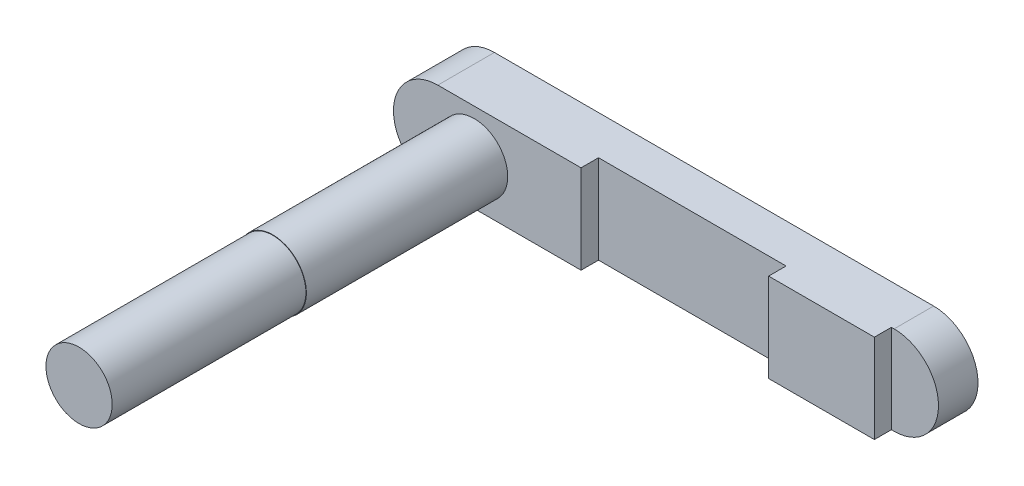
from build123d import *

# Parameters (mm, degrees)
BOSS_EXTRUDE1_DEPTH = 3.96748
SKETCH2_W           = 9.973445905
SKETCH2_H           = 10.38557177
SKETCH2_W_2         = 13.1572
SKETCH2_H_2         = 9.478894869
CUT_EXTRUDE1_DEPTH  = 9.04748
SKETCH3_R           = 2.35585
BOSS_EXTRUDE2_DEPTH = 27.7114
SKETCH4_R           = 4.010294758
SKETCH4_R_2         = 2.3241
CUT_EXTRUDE2_DEPTH  = 13.589


with BuildPart() as part:
    # Sketch1 → Boss-Extrude1 (new body)
    with BuildSketch(Plane.XY):
        with BuildLine():
            Line((3.1115, 6.223), (33.9217, 6.223))
            ThreePointArc((33.9217, 6.223), (37.0332, 3.1115), (33.9217, 0))
            Line((33.9217, 0), (3.1115, 0))
            ThreePointArc((3.1115, 0), (0, 3.1115), (3.1115, 6.223))
        make_face()
    extrude(amount=BOSS_EXTRUDE1_DEPTH)

    # Sketch2 → Cut-Extrude1 (cut)
    with BuildSketch(Plane(origin=(0, 0, 0), x_dir=(1, 0, 0), z_dir=(0, 1, 0))):
        with Locations((38.717922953, -7.964054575)):
            Rectangle(SKETCH2_W, SKETCH2_H)
        with Locations((19.7358, -7.482647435)):
            Rectangle(SKETCH2_W_2, SKETCH2_H_2)
    extrude(amount=CUT_EXTRUDE1_DEPTH, mode=Mode.SUBTRACT)

    # Sketch3 → Boss-Extrude2 (add)
    with BuildSketch(Plane.XY.offset(3.96748)):
        with Locations(Location((5.65785, 3.1115, 0), (0, 0, 180))):
            Circle(SKETCH3_R)
    extrude(amount=BOSS_EXTRUDE2_DEPTH)

    # Sketch4 → Cut-Extrude2 (cut)
    with BuildSketch(Plane.XY.offset(31.67888)):
        with Locations((5.65785, 3.1115)):
            Circle(SKETCH4_R)
        with Locations((5.65785, 3.1115)):
            Circle(SKETCH4_R_2, mode=Mode.SUBTRACT)
    extrude(amount=-CUT_EXTRUDE2_DEPTH, mode=Mode.SUBTRACT)


solid = part.part
